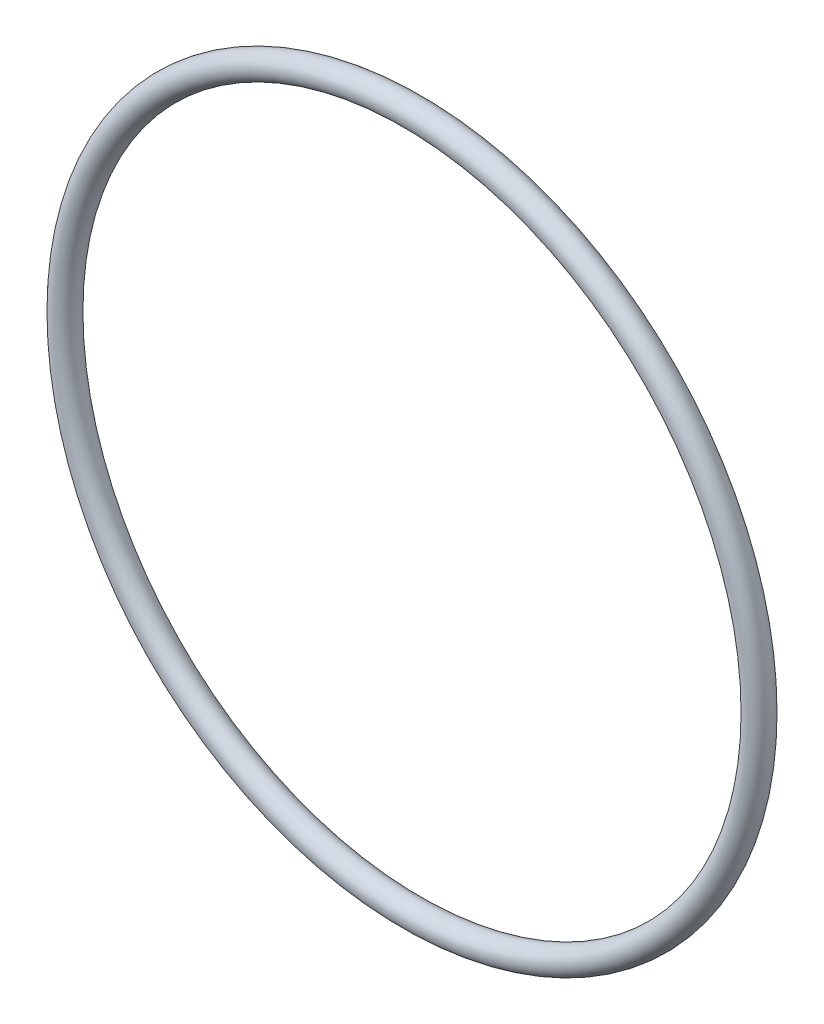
ISO-10303-21;
HEADER;
FILE_DESCRIPTION(('STEP AP214'),'2;1');
FILE_NAME('part.step','',(''),(''),'','','');
FILE_SCHEMA(('AUTOMOTIVE_DESIGN { 1 0 10303 214 1 1 1 1 }'));
ENDSEC;
DATA;
#1=APPLICATION_CONTEXT('core data for automotive mechanical design processes');
#2=APPLICATION_PROTOCOL_DEFINITION('international standard','automotive_design',2000,#1);
#3=PRODUCT_CONTEXT('',#1,'mechanical');
#4=PRODUCT('Part','Part','',(#3));
#5=PRODUCT_RELATED_PRODUCT_CATEGORY('part','',(#4));
#6=PRODUCT_DEFINITION_FORMATION('','',#4);
#7=PRODUCT_DEFINITION_CONTEXT('part definition',#1,'design');
#8=PRODUCT_DEFINITION('design','',#6,#7);
#9=PRODUCT_DEFINITION_SHAPE('','',#8);
#10=(LENGTH_UNIT() NAMED_UNIT(*) SI_UNIT(.MILLI.,.METRE.));
#11=(NAMED_UNIT(*) PLANE_ANGLE_UNIT() SI_UNIT($,.RADIAN.));
#12=(NAMED_UNIT(*) SI_UNIT($,.STERADIAN.) SOLID_ANGLE_UNIT());
#13=UNCERTAINTY_MEASURE_WITH_UNIT(LENGTH_MEASURE(1.E-05),#10,'distance_accuracy_value','');
#14=(GEOMETRIC_REPRESENTATION_CONTEXT(3) GLOBAL_UNCERTAINTY_ASSIGNED_CONTEXT((#13)) GLOBAL_UNIT_ASSIGNED_CONTEXT((#10,
#11,#12)) REPRESENTATION_CONTEXT('',''));
#15=CARTESIAN_POINT('',(0.,0.,0.));
#16=DIRECTION('',(0.,0.,1.));
#17=DIRECTION('',(1.,0.,0.));
#18=AXIS2_PLACEMENT_3D('',#15,#16,#17);
#19=CARTESIAN_POINT('',(0.,0.,0.));
#20=DIRECTION('',(0.,0.,1.));
#21=DIRECTION('',(1.,0.,0.));
#22=AXIS2_PLACEMENT_3D('',#19,#20,#21);
#23=TOROIDAL_SURFACE('',#22,95.25,3.49249999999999);
#24=CARTESIAN_POINT('',(98.7425,0.,0.));
#25=VERTEX_POINT('',#24);
#26=VERTEX_LOOP('',#25);
#27=FACE_BOUND('',#26,.T.);
#28=ADVANCED_FACE('F30',(#27),#23,.T.);
#29=CLOSED_SHELL('',(#28));
#30=MANIFOLD_SOLID_BREP('B2',#29);
#31=ADVANCED_BREP_SHAPE_REPRESENTATION('',(#18,#30),#14);
#32=SHAPE_DEFINITION_REPRESENTATION(#9,#31);
ENDSEC;
END-ISO-10303-21;
